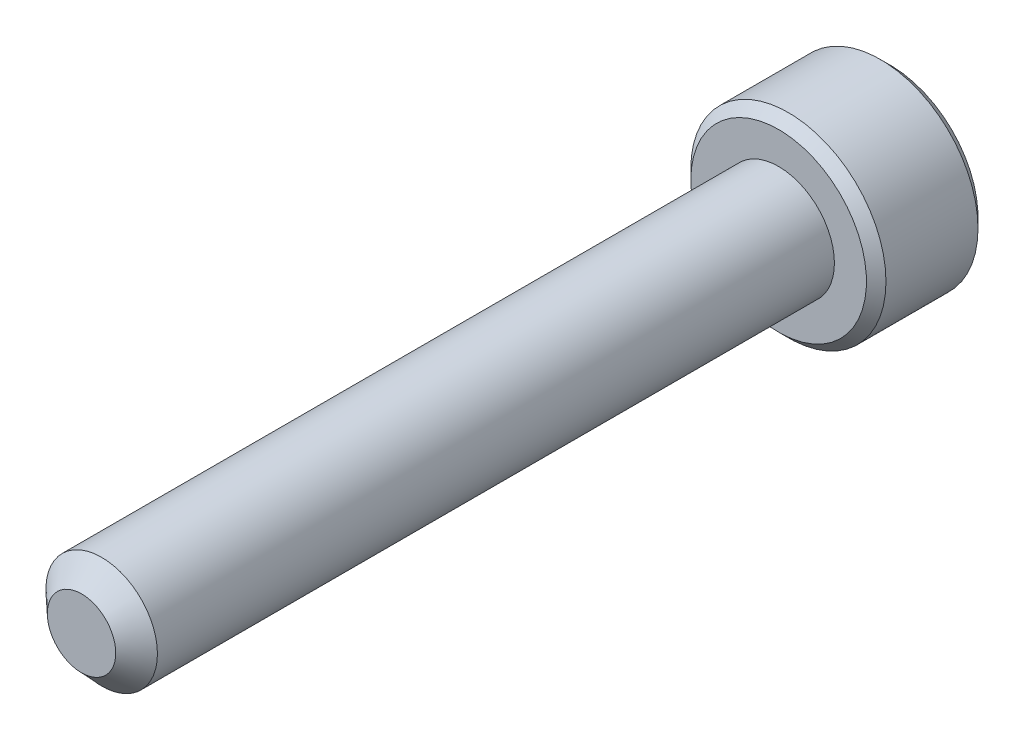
ISO-10303-21;
HEADER;
FILE_DESCRIPTION(('STEP AP214'),'2;1');
FILE_NAME('part.step','',(''),(''),'','','');
FILE_SCHEMA(('AUTOMOTIVE_DESIGN { 1 0 10303 214 1 1 1 1 }'));
ENDSEC;
DATA;
#1=APPLICATION_CONTEXT('core data for automotive mechanical design processes');
#2=APPLICATION_PROTOCOL_DEFINITION('international standard','automotive_design',2000,#1);
#3=PRODUCT_CONTEXT('',#1,'mechanical');
#4=PRODUCT('Part','Part','',(#3));
#5=PRODUCT_RELATED_PRODUCT_CATEGORY('part','',(#4));
#6=PRODUCT_DEFINITION_FORMATION('','',#4);
#7=PRODUCT_DEFINITION_CONTEXT('part definition',#1,'design');
#8=PRODUCT_DEFINITION('design','',#6,#7);
#9=PRODUCT_DEFINITION_SHAPE('','',#8);
#10=(LENGTH_UNIT() NAMED_UNIT(*) SI_UNIT(.MILLI.,.METRE.));
#11=(NAMED_UNIT(*) PLANE_ANGLE_UNIT() SI_UNIT($,.RADIAN.));
#12=(NAMED_UNIT(*) SI_UNIT($,.STERADIAN.) SOLID_ANGLE_UNIT());
#13=UNCERTAINTY_MEASURE_WITH_UNIT(LENGTH_MEASURE(1.E-05),#10,'distance_accuracy_value','');
#14=(GEOMETRIC_REPRESENTATION_CONTEXT(3) GLOBAL_UNCERTAINTY_ASSIGNED_CONTEXT((#13)) GLOBAL_UNIT_ASSIGNED_CONTEXT((#10,
#11,#12)) REPRESENTATION_CONTEXT('',''));
#15=CARTESIAN_POINT('',(0.,0.,0.));
#16=DIRECTION('',(0.,0.,1.));
#17=DIRECTION('',(1.,0.,0.));
#18=AXIS2_PLACEMENT_3D('',#15,#16,#17);
#19=CARTESIAN_POINT('',(0.,0.,-25.));
#20=DIRECTION('',(0.,0.,1.));
#21=DIRECTION('',(1.,0.,0.));
#22=AXIS2_PLACEMENT_3D('',#19,#20,#21);
#23=CYLINDRICAL_SURFACE('',#22,2.);
#24=CARTESIAN_POINT('',(0.,0.,-25.));
#25=DIRECTION('',(0.,0.,-1.));
#26=DIRECTION('',(-1.,0.,0.));
#27=AXIS2_PLACEMENT_3D('',#24,#25,#26);
#28=CIRCLE('',#27,2.);
#29=CARTESIAN_POINT('',(-2.,0.,-25.));
#30=VERTEX_POINT('',#29);
#31=EDGE_CURVE('E203',#30,#30,#28,.F.);
#32=ORIENTED_EDGE('',*,*,#31,.T.);
#33=EDGE_LOOP('',(#32));
#34=FACE_BOUND('',#33,.T.);
#35=CARTESIAN_POINT('',(0.,0.,-0.721407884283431));
#36=DIRECTION('',(0.,0.,1.));
#37=DIRECTION('',(1.,0.,0.));
#38=AXIS2_PLACEMENT_3D('',#35,#36,#37);
#39=CIRCLE('',#38,2.);
#40=CARTESIAN_POINT('',(2.,0.,-0.721407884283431));
#41=VERTEX_POINT('',#40);
#42=EDGE_CURVE('E107',#41,#41,#39,.T.);
#43=ORIENTED_EDGE('',*,*,#42,.F.);
#44=EDGE_LOOP('',(#43));
#45=FACE_BOUND('',#44,.T.);
#46=ADVANCED_FACE('F34',(#34,#45),#23,.T.);
#47=CARTESIAN_POINT('',(0.,0.,0.));
#48=DIRECTION('',(0.,0.,-1.));
#49=DIRECTION('',(-1.,0.,0.));
#50=AXIS2_PLACEMENT_3D('',#47,#48,#49);
#51=CONICAL_SURFACE('',#50,1.22638475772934,0.820304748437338);
#52=ORIENTED_EDGE('',*,*,#42,.T.);
#53=EDGE_LOOP('',(#52));
#54=FACE_BOUND('',#53,.T.);
#55=CARTESIAN_POINT('',(0.,0.,0.));
#56=DIRECTION('',(0.,0.,1.));
#57=DIRECTION('',(1.,0.,0.));
#58=AXIS2_PLACEMENT_3D('',#55,#56,#57);
#59=CIRCLE('',#58,1.22638475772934);
#60=CARTESIAN_POINT('',(1.22638475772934,0.,0.));
#61=VERTEX_POINT('',#60);
#62=EDGE_CURVE('E206',#61,#61,#59,.T.);
#63=ORIENTED_EDGE('',*,*,#62,.F.);
#64=EDGE_LOOP('',(#63));
#65=FACE_BOUND('',#64,.T.);
#66=ADVANCED_FACE('F193',(#54,#65),#51,.T.);
#67=CARTESIAN_POINT('',(0.,0.,0.));
#68=DIRECTION('',(0.,0.,1.));
#69=DIRECTION('',(1.,0.,0.));
#70=AXIS2_PLACEMENT_3D('',#67,#68,#69);
#71=PLANE('',#70);
#72=ORIENTED_EDGE('',*,*,#62,.T.);
#73=EDGE_LOOP('',(#72));
#74=FACE_BOUND('',#73,.T.);
#75=ADVANCED_FACE('F190',(#74),#71,.T.);
#76=CARTESIAN_POINT('',(0.,0.,-29.));
#77=DIRECTION('',(0.,0.,1.));
#78=DIRECTION('',(1.,0.,0.));
#79=AXIS2_PLACEMENT_3D('',#76,#77,#78);
#80=CYLINDRICAL_SURFACE('',#79,3.5);
#81=CARTESIAN_POINT('',(0.,0.,-28.65));
#82=DIRECTION('',(0.,0.,-1.));
#83=DIRECTION('',(-1.,0.,0.));
#84=AXIS2_PLACEMENT_3D('',#81,#82,#83);
#85=CIRCLE('',#84,3.5);
#86=CARTESIAN_POINT('',(-3.5,0.,-28.65));
#87=VERTEX_POINT('',#86);
#88=EDGE_CURVE('E41',#87,#87,#85,.F.);
#89=ORIENTED_EDGE('',*,*,#88,.T.);
#90=EDGE_LOOP('',(#89));
#91=FACE_BOUND('',#90,.T.);
#92=CARTESIAN_POINT('',(0.,0.,-25.35));
#93=DIRECTION('',(0.,0.,-1.));
#94=DIRECTION('',(-1.,0.,0.));
#95=AXIS2_PLACEMENT_3D('',#92,#93,#94);
#96=CIRCLE('',#95,3.5);
#97=CARTESIAN_POINT('',(-3.5,0.,-25.35));
#98=VERTEX_POINT('',#97);
#99=EDGE_CURVE('E168',#98,#98,#96,.T.);
#100=ORIENTED_EDGE('',*,*,#99,.T.);
#101=EDGE_LOOP('',(#100));
#102=FACE_BOUND('',#101,.T.);
#103=ADVANCED_FACE('F173',(#91,#102),#80,.T.);
#104=CARTESIAN_POINT('',(0.,0.,-29.));
#105=DIRECTION('',(0.,0.,-1.));
#106=DIRECTION('',(-1.,0.,0.));
#107=AXIS2_PLACEMENT_3D('',#104,#105,#106);
#108=PLANE('',#107);
#109=CARTESIAN_POINT('',(0.,0.,-29.));
#110=DIRECTION('',(0.,0.,-1.));
#111=DIRECTION('',(-1.,0.,0.));
#112=AXIS2_PLACEMENT_3D('',#109,#110,#111);
#113=CIRCLE('',#112,3.15);
#114=CARTESIAN_POINT('',(-3.15000000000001,0.,-29.));
#115=VERTEX_POINT('',#114);
#116=EDGE_CURVE('E106',#115,#115,#113,.T.);
#117=ORIENTED_EDGE('',*,*,#116,.T.);
#118=EDGE_LOOP('',(#117));
#119=FACE_BOUND('',#118,.T.);
#120=CARTESIAN_POINT('',(0.,0.,-29.));
#121=DIRECTION('',(0.,0.,-1.));
#122=DIRECTION('',(-1.,0.,0.));
#123=AXIS2_PLACEMENT_3D('',#120,#121,#122);
#124=CIRCLE('',#123,1.73205080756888);
#125=CARTESIAN_POINT('',(-1.5,0.866025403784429,-29.));
#126=VERTEX_POINT('',#125);
#127=CARTESIAN_POINT('',(0.,1.73205080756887,-29.));
#128=VERTEX_POINT('',#127);
#129=EDGE_CURVE('E87',#126,#128,#124,.T.);
#130=ORIENTED_EDGE('',*,*,#129,.F.);
#131=CARTESIAN_POINT('',(-1.49999999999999,-0.866025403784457,-29.));
#132=VERTEX_POINT('',#131);
#133=EDGE_CURVE('E47',#132,#126,#124,.T.);
#134=ORIENTED_EDGE('',*,*,#133,.F.);
#135=CARTESIAN_POINT('',(0.,-1.73205080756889,-29.));
#136=VERTEX_POINT('',#135);
#137=EDGE_CURVE('E264',#136,#132,#124,.T.);
#138=ORIENTED_EDGE('',*,*,#137,.F.);
#139=CARTESIAN_POINT('',(1.49999999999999,-0.866025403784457,-29.));
#140=VERTEX_POINT('',#139);
#141=EDGE_CURVE('E54',#140,#136,#124,.T.);
#142=ORIENTED_EDGE('',*,*,#141,.F.);
#143=CARTESIAN_POINT('',(1.5,0.866025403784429,-29.));
#144=VERTEX_POINT('',#143);
#145=EDGE_CURVE('E128',#144,#140,#124,.T.);
#146=ORIENTED_EDGE('',*,*,#145,.F.);
#147=EDGE_CURVE('E96',#128,#144,#124,.T.);
#148=ORIENTED_EDGE('',*,*,#147,.F.);
#149=EDGE_LOOP('',(#130,#134,#138,#142,#146,#148));
#150=FACE_BOUND('',#149,.T.);
#151=ADVANCED_FACE('F127',(#119,#150),#108,.T.);
#152=CARTESIAN_POINT('',(0.,0.,-25.));
#153=DIRECTION('',(0.,0.,-1.));
#154=DIRECTION('',(-1.,0.,0.));
#155=AXIS2_PLACEMENT_3D('',#152,#153,#154);
#156=PLANE('',#155);
#157=CARTESIAN_POINT('',(0.,0.,-25.));
#158=DIRECTION('',(0.,0.,-1.));
#159=DIRECTION('',(-1.,0.,0.));
#160=AXIS2_PLACEMENT_3D('',#157,#158,#159);
#161=CIRCLE('',#160,3.15);
#162=CARTESIAN_POINT('',(-3.15,0.,-25.));
#163=VERTEX_POINT('',#162);
#164=EDGE_CURVE('E11',#163,#163,#161,.F.);
#165=ORIENTED_EDGE('',*,*,#164,.T.);
#166=EDGE_LOOP('',(#165));
#167=FACE_BOUND('',#166,.T.);
#168=ORIENTED_EDGE('',*,*,#31,.F.);
#169=EDGE_LOOP('',(#168));
#170=FACE_BOUND('',#169,.T.);
#171=ADVANCED_FACE('F183',(#167,#170),#156,.F.);
#172=CARTESIAN_POINT('',(0.,0.,-29.));
#173=DIRECTION('',(0.,0.,-1.));
#174=DIRECTION('',(-1.,0.,0.));
#175=AXIS2_PLACEMENT_3D('',#172,#173,#174);
#176=CONICAL_SURFACE('',#175,1.73205080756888,0.78539816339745);
#177=ORIENTED_EDGE('',*,*,#147,.T.);
#178=CARTESIAN_POINT('',(-0.000200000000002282,1.73216627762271,-29.0001154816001));
#179=CARTESIAN_POINT('',(0.0513677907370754,1.70239359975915,-28.9703654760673));
#180=CARTESIAN_POINT('',(0.103797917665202,1.67212305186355,-28.9423624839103));
#181=CARTESIAN_POINT('',(0.2107090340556,1.61039789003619,-28.8910892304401));
#182=CARTESIAN_POINT('',(0.265200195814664,1.57893740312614,-28.8678475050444));
#183=CARTESIAN_POINT('',(0.375079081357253,1.51549879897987,-28.8280337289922));
#184=CARTESIAN_POINT('',(0.430438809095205,1.4835368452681,-28.8113615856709));
#185=CARTESIAN_POINT('',(0.542377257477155,1.41890915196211,-28.7856744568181));
#186=CARTESIAN_POINT('',(0.598952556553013,1.38624538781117,-28.7766402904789));
#187=CARTESIAN_POINT('',(0.696455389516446,1.32995210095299,-28.7684890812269));
#188=CARTESIAN_POINT('',(0.737256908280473,1.30639533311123,-28.7672822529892));
#189=CARTESIAN_POINT('',(0.818787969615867,1.25932335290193,-28.7693140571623));
#190=CARTESIAN_POINT('',(0.859517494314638,1.23580815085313,-28.7725536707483));
#191=CARTESIAN_POINT('',(0.940584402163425,1.18900414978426,-28.783291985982));
#192=CARTESIAN_POINT('',(0.980921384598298,1.16571558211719,-28.7907946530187));
#193=CARTESIAN_POINT('',(1.06091833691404,1.11952932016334,-28.8096516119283));
#194=CARTESIAN_POINT('',(1.10057800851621,1.09663179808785,-28.8210075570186));
#195=CARTESIAN_POINT('',(1.20216313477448,1.03798159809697,-28.8547216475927));
#196=CARTESIAN_POINT('',(1.26345855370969,1.00259267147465,-28.8796218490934));
#197=CARTESIAN_POINT('',(1.35358562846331,0.950557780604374,-28.9216566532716));
#198=CARTESIAN_POINT('',(1.38328513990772,0.933410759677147,-28.9364251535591));
#199=CARTESIAN_POINT('',(1.44213790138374,0.899432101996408,-28.9673105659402));
#200=CARTESIAN_POINT('',(1.47129140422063,0.882600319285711,-28.9834268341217));
#201=CARTESIAN_POINT('',(1.50019999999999,0.865909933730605,-29.0001154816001));
#202=B_SPLINE_CURVE_WITH_KNOTS('',3,(#178,#179,#180,#181,#182,#183,#184,#185,#186,#187,#188,
#189,#190,#191,#192,#193,#194,#195,#196,#197,#198,#199,#200,#201),.UNSPECIFIED.,.F.,.F.,(4,2,2,
2,2,2,2,2,2,2,2,4),(0.,0.19982914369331,0.400822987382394,0.598623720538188,0.795926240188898,
0.937113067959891,1.07833105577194,1.21968061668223,1.36109089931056,1.58570969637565,
1.69770705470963,1.80965120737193),.UNSPECIFIED.);
#203=EDGE_CURVE('E101',#128,#144,#202,.T.);
#204=ORIENTED_EDGE('',*,*,#203,.F.);
#205=EDGE_LOOP('',(#177,#204));
#206=FACE_BOUND('',#205,.T.);
#207=ADVANCED_FACE('F102',(#206),#176,.F.);
#208=ORIENTED_EDGE('',*,*,#145,.T.);
#209=CARTESIAN_POINT('',(1.49999999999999,-1.72720812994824,-29.5555785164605));
#210=CARTESIAN_POINT('',(1.5,-1.68515175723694,-29.5238299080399));
#211=CARTESIAN_POINT('',(1.5,-1.64286104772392,-29.4923925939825));
#212=CARTESIAN_POINT('',(1.5,-1.55771581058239,-29.430269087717));
#213=CARTESIAN_POINT('',(1.5,-1.51486114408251,-29.3995830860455));
#214=CARTESIAN_POINT('',(1.5,-1.38468134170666,-29.3084071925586));
#215=CARTESIAN_POINT('',(1.5,-1.29637976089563,-29.2492883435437));
#216=CARTESIAN_POINT('',(1.5,-1.11121478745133,-29.1332309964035));
#217=CARTESIAN_POINT('',(1.50000000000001,-1.01415038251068,-29.0766095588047));
#218=CARTESIAN_POINT('',(1.5,-0.81517340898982,-28.9730368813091));
#219=CARTESIAN_POINT('',(1.49999999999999,-0.713278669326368,-28.9260530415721));
#220=CARTESIAN_POINT('',(1.49999999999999,-0.560333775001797,-28.8685726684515));
#221=CARTESIAN_POINT('',(1.5,-0.511547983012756,-28.8520753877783));
#222=CARTESIAN_POINT('',(1.5,-0.412798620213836,-28.8229975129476));
#223=CARTESIAN_POINT('',(1.5,-0.362834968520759,-28.8104171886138));
#224=CARTESIAN_POINT('',(1.5,-0.262863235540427,-28.7900361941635));
#225=CARTESIAN_POINT('',(1.5,-0.212872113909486,-28.7821536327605));
#226=CARTESIAN_POINT('',(1.5,-0.112355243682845,-28.7713220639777));
#227=CARTESIAN_POINT('',(1.49999999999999,-0.0618295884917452,-28.7683722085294));
#228=CARTESIAN_POINT('',(1.49999999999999,0.0374291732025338,-28.7676248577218));
#229=CARTESIAN_POINT('',(1.5,0.0861609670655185,-28.7696447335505));
#230=CARTESIAN_POINT('',(1.5,0.183206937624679,-28.7783225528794));
#231=CARTESIAN_POINT('',(1.5,0.231521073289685,-28.7849809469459));
#232=CARTESIAN_POINT('',(1.5,0.328199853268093,-28.802685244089));
#233=CARTESIAN_POINT('',(1.5,0.376550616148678,-28.8138058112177));
#234=CARTESIAN_POINT('',(1.5,0.472195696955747,-28.8398434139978));
#235=CARTESIAN_POINT('',(1.5,0.519490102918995,-28.8547601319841));
#236=CARTESIAN_POINT('',(1.49999999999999,0.66839128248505,-28.9073352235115));
#237=CARTESIAN_POINT('',(1.5,0.767878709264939,-28.9509812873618));
#238=CARTESIAN_POINT('',(1.5,0.962179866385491,-29.0480229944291));
#239=CARTESIAN_POINT('',(1.5,1.05697519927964,-29.1014536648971));
#240=CARTESIAN_POINT('',(1.5,1.23814273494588,-29.2116858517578));
#241=CARTESIAN_POINT('',(1.5,1.32469942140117,-29.2681879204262));
#242=CARTESIAN_POINT('',(1.5,1.45222331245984,-29.3555343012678));
#243=CARTESIAN_POINT('',(1.5,1.49418091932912,-29.3849577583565));
#244=CARTESIAN_POINT('',(1.5,1.57752272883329,-29.4445828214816));
#245=CARTESIAN_POINT('',(1.5,1.61890708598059,-29.4747842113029));
#246=CARTESIAN_POINT('',(1.49999999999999,1.66005277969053,-29.5053081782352));
#247=B_SPLINE_CURVE_WITH_KNOTS('',3,(#209,#210,#211,#212,#213,#214,#215,#216,#217,#218,#219,
#220,#221,#222,#223,#224,#225,#226,#227,#228,#229,#230,#231,#232,#233,#234,#235,#236,#237,#238,
#239,#240,#241,#242,#243,#244,#245,#246),.UNSPECIFIED.,.F.,.F.,(4,2,2,2,2,2,2,2,2,2,2,2,2,2,2,2,
2,2,4),(0.,0.158079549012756,0.316198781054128,0.634850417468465,0.971690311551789,
1.30737131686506,1.46173961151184,1.61611853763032,1.76772101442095,1.91929742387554,
2.06538741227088,2.21149159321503,2.36014984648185,2.50879566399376,2.83376031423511,
3.15991186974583,3.46985601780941,3.62358896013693,3.77727962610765),.UNSPECIFIED.);
#248=EDGE_CURVE('E95',#144,#140,#247,.F.);
#249=ORIENTED_EDGE('',*,*,#248,.F.);
#250=EDGE_LOOP('',(#208,#249));
#251=FACE_BOUND('',#250,.T.);
#252=ADVANCED_FACE('F270',(#251),#176,.F.);
#253=ORIENTED_EDGE('',*,*,#141,.T.);
#254=CARTESIAN_POINT('',(1.5002,-0.865909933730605,-29.0001154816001));
#255=CARTESIAN_POINT('',(1.44863220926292,-0.895682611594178,-28.9703654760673));
#256=CARTESIAN_POINT('',(1.3962020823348,-0.925953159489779,-28.9423624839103));
#257=CARTESIAN_POINT('',(1.2892909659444,-0.98767832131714,-28.8910892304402));
#258=CARTESIAN_POINT('',(1.23479980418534,-1.01913880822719,-28.8678475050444));
#259=CARTESIAN_POINT('',(1.12492091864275,-1.08257741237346,-28.8280337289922));
#260=CARTESIAN_POINT('',(1.0695611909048,-1.11453936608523,-28.8113615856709));
#261=CARTESIAN_POINT('',(0.957622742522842,-1.17916705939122,-28.7856744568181));
#262=CARTESIAN_POINT('',(0.90104744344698,-1.21183082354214,-28.7766402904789));
#263=CARTESIAN_POINT('',(0.80354461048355,-1.26812411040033,-28.7684890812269));
#264=CARTESIAN_POINT('',(0.762743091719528,-1.29168087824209,-28.7672822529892));
#265=CARTESIAN_POINT('',(0.681212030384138,-1.3387528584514,-28.7693140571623));
#266=CARTESIAN_POINT('',(0.640482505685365,-1.3622680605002,-28.7725536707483));
#267=CARTESIAN_POINT('',(0.559415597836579,-1.40907206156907,-28.783291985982));
#268=CARTESIAN_POINT('',(0.519078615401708,-1.43236062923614,-28.7907946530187));
#269=CARTESIAN_POINT('',(0.439081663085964,-1.47854689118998,-28.8096516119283));
#270=CARTESIAN_POINT('',(0.399421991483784,-1.50144441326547,-28.8210075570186));
#271=CARTESIAN_POINT('',(0.297836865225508,-1.56009461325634,-28.8547216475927));
#272=CARTESIAN_POINT('',(0.236541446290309,-1.59548353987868,-28.8796218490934));
#273=CARTESIAN_POINT('',(0.14641437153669,-1.64751843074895,-28.9216566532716));
#274=CARTESIAN_POINT('',(0.116714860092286,-1.66466545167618,-28.9364251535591));
#275=CARTESIAN_POINT('',(0.0578620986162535,-1.69864410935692,-28.9673105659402));
#276=CARTESIAN_POINT('',(0.0287085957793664,-1.71547589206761,-28.9834268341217));
#277=CARTESIAN_POINT('',(-0.000199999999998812,-1.73216627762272,-29.0001154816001));
#278=B_SPLINE_CURVE_WITH_KNOTS('',3,(#254,#255,#256,#257,#258,#259,#260,#261,#262,#263,#264,
#265,#266,#267,#268,#269,#270,#271,#272,#273,#274,#275,#276,#277),.UNSPECIFIED.,.F.,.F.,(4,2,2,
2,2,2,2,2,2,2,2,4),(0.,0.199829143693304,0.400822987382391,0.598623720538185,0.795926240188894,
0.937113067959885,1.07833105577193,1.21968061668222,1.36109089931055,1.58570969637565,
1.69770705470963,1.80965120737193),.UNSPECIFIED.);
#279=EDGE_CURVE('E137',#140,#136,#278,.T.);
#280=ORIENTED_EDGE('',*,*,#279,.F.);
#281=EDGE_LOOP('',(#253,#280));
#282=FACE_BOUND('',#281,.T.);
#283=ADVANCED_FACE('F267',(#282),#176,.F.);
#284=ORIENTED_EDGE('',*,*,#137,.T.);
#285=CARTESIAN_POINT('',(0.000199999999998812,-1.73216627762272,-29.0001154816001));
#286=CARTESIAN_POINT('',(-0.0513677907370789,-1.70239359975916,-28.9703654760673));
#287=CARTESIAN_POINT('',(-0.103797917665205,-1.67212305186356,-28.9423624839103));
#288=CARTESIAN_POINT('',(-0.210709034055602,-1.6103978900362,-28.8910892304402));
#289=CARTESIAN_POINT('',(-0.265200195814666,-1.57893740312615,-28.8678475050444));
#290=CARTESIAN_POINT('',(-0.375079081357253,-1.51549879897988,-28.8280337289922));
#291=CARTESIAN_POINT('',(-0.430438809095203,-1.48353684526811,-28.8113615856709));
#292=CARTESIAN_POINT('',(-0.542377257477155,-1.41890915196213,-28.7856744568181));
#293=CARTESIAN_POINT('',(-0.598952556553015,-1.3862453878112,-28.7766402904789));
#294=CARTESIAN_POINT('',(-0.696455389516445,-1.32995210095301,-28.7684890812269));
#295=CARTESIAN_POINT('',(-0.737256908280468,-1.30639533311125,-28.7672822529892));
#296=CARTESIAN_POINT('',(-0.818787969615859,-1.25932335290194,-28.7693140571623));
#297=CARTESIAN_POINT('',(-0.859517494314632,-1.23580815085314,-28.7725536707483));
#298=CARTESIAN_POINT('',(-0.940584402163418,-1.18900414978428,-28.783291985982));
#299=CARTESIAN_POINT('',(-0.98092138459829,-1.16571558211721,-28.7907946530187));
#300=CARTESIAN_POINT('',(-1.06091833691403,-1.11952932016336,-28.8096516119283));
#301=CARTESIAN_POINT('',(-1.10057800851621,-1.09663179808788,-28.8210075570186));
#302=CARTESIAN_POINT('',(-1.20216313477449,-1.037981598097,-28.8547216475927));
#303=CARTESIAN_POINT('',(-1.26345855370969,-1.00259267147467,-28.8796218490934));
#304=CARTESIAN_POINT('',(-1.35358562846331,-0.950557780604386,-28.9216566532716));
#305=CARTESIAN_POINT('',(-1.38328513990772,-0.933410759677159,-28.9364251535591));
#306=CARTESIAN_POINT('',(-1.44213790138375,-0.89943210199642,-28.9673105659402));
#307=CARTESIAN_POINT('',(-1.47129140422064,-0.882600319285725,-28.9834268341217));
#308=CARTESIAN_POINT('',(-1.5002,-0.865909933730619,-29.0001154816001));
#309=B_SPLINE_CURVE_WITH_KNOTS('',3,(#285,#286,#287,#288,#289,#290,#291,#292,#293,#294,#295,
#296,#297,#298,#299,#300,#301,#302,#303,#304,#305,#306,#307,#308),.UNSPECIFIED.,.F.,.F.,(4,2,2,
2,2,2,2,2,2,2,2,4),(0.,0.199829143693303,0.400822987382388,0.598623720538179,0.795926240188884,
0.937113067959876,1.07833105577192,1.21968061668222,1.36109089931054,1.58570969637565,
1.69770705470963,1.80965120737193),.UNSPECIFIED.);
#310=EDGE_CURVE('E242',#136,#132,#309,.T.);
#311=ORIENTED_EDGE('',*,*,#310,.F.);
#312=EDGE_LOOP('',(#284,#311));
#313=FACE_BOUND('',#312,.T.);
#314=ADVANCED_FACE('F266',(#313),#176,.F.);
#315=ORIENTED_EDGE('',*,*,#133,.T.);
#316=CARTESIAN_POINT('',(-1.50000000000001,-1.72720812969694,-29.5555785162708));
#317=CARTESIAN_POINT('',(-1.5,-1.68515175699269,-29.5238299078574));
#318=CARTESIAN_POINT('',(-1.5,-1.64286104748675,-29.4923925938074));
#319=CARTESIAN_POINT('',(-1.49999999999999,-1.55771581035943,-29.4302690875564));
#320=CARTESIAN_POINT('',(-1.49999999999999,-1.51486114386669,-29.3995830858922));
#321=CARTESIAN_POINT('',(-1.5,-1.38468134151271,-29.3084071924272));
#322=CARTESIAN_POINT('',(-1.5,-1.29637976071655,-29.2492883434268));
#323=CARTESIAN_POINT('',(-1.49999999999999,-1.11121478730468,-29.1332309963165));
#324=CARTESIAN_POINT('',(-1.49999999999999,-1.01415038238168,-29.076609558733));
#325=CARTESIAN_POINT('',(-1.5,-0.81517340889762,-28.9730368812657));
#326=CARTESIAN_POINT('',(-1.50000000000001,-0.713278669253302,-28.9260530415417));
#327=CARTESIAN_POINT('',(-1.5,-0.56033377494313,-28.8685726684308));
#328=CARTESIAN_POINT('',(-1.5,-0.511547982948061,-28.8520753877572));
#329=CARTESIAN_POINT('',(-1.49999999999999,-0.412798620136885,-28.822997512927));
#330=CARTESIAN_POINT('',(-1.49999999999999,-0.362834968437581,-28.810417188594));
#331=CARTESIAN_POINT('',(-1.49999999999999,-0.262863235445,-28.7900361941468));
#332=CARTESIAN_POINT('',(-1.49999999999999,-0.21287211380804,-28.782153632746));
#333=CARTESIAN_POINT('',(-1.5,-0.112355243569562,-28.771322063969));
#334=CARTESIAN_POINT('',(-1.5,-0.0618295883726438,-28.7683722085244));
#335=CARTESIAN_POINT('',(-1.5,0.0374291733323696,-28.7676248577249));
#336=CARTESIAN_POINT('',(-1.5,0.0861609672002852,-28.7696447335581));
#337=CARTESIAN_POINT('',(-1.49999999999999,0.183206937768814,-28.7783225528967));
#338=CARTESIAN_POINT('',(-1.49999999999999,0.231521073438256,-28.7849809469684));
#339=CARTESIAN_POINT('',(-1.49999999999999,0.328199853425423,-28.8026852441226));
#340=CARTESIAN_POINT('',(-1.49999999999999,0.376550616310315,-28.813805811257));
#341=CARTESIAN_POINT('',(-1.5,0.472195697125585,-28.8398434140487));
#342=CARTESIAN_POINT('',(-1.5,0.519490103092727,-28.8547601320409));
#343=CARTESIAN_POINT('',(-1.5,0.668391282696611,-28.9073352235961));
#344=CARTESIAN_POINT('',(-1.5,0.767878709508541,-28.950981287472));
#345=CARTESIAN_POINT('',(-1.49999999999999,0.962179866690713,-29.0480229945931));
#346=CARTESIAN_POINT('',(-1.49999999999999,1.05697519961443,-29.1014536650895));
#347=CARTESIAN_POINT('',(-1.5,1.23814273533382,-29.2116858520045));
#348=CARTESIAN_POINT('',(-1.5,1.32469942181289,-29.2681879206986));
#349=CARTESIAN_POINT('',(-1.5,1.45222331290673,-29.3555343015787));
#350=CARTESIAN_POINT('',(-1.49999999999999,1.49418091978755,-29.38495775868));
#351=CARTESIAN_POINT('',(-1.5,1.57752272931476,-29.4445828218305));
#352=CARTESIAN_POINT('',(-1.5,1.61890708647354,-29.4747842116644));
#353=CARTESIAN_POINT('',(-1.5,1.66005278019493,-29.5053081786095));
#354=B_SPLINE_CURVE_WITH_KNOTS('',3,(#316,#317,#318,#319,#320,#321,#322,#323,#324,#325,#326,
#327,#328,#329,#330,#331,#332,#333,#334,#335,#336,#337,#338,#339,#340,#341,#342,#343,#344,#345,
#346,#347,#348,#349,#350,#351,#352,#353),.UNSPECIFIED.,.F.,.F.,(4,2,2,2,2,2,2,2,2,2,2,2,2,2,2,2,
2,2,4),(0.,0.158079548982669,0.316198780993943,0.634850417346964,0.971690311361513,
1.30737131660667,1.46173961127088,1.61611853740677,1.7677210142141,1.91929742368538,
2.06538741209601,2.21149159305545,2.36014984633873,2.5087956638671,2.83376031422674,
3.15991186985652,3.46985601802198,3.62358896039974,3.77727962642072),.UNSPECIFIED.);
#355=EDGE_CURVE('E117',#132,#126,#354,.T.);
#356=ORIENTED_EDGE('',*,*,#355,.F.);
#357=EDGE_LOOP('',(#315,#356));
#358=FACE_BOUND('',#357,.T.);
#359=ADVANCED_FACE('F279',(#358),#176,.F.);
#360=ORIENTED_EDGE('',*,*,#129,.T.);
#361=CARTESIAN_POINT('',(-1.50020000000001,0.865909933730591,-29.0001154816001));
#362=CARTESIAN_POINT('',(-1.44863220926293,0.895682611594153,-28.9703654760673));
#363=CARTESIAN_POINT('',(-1.39620208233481,0.925953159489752,-28.9423624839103));
#364=CARTESIAN_POINT('',(-1.28929096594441,0.987678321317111,-28.8910892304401));
#365=CARTESIAN_POINT('',(-1.23479980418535,1.01913880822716,-28.8678475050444));
#366=CARTESIAN_POINT('',(-1.12492091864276,1.08257741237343,-28.8280337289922));
#367=CARTESIAN_POINT('',(-1.06956119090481,1.1145393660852,-28.8113615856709));
#368=CARTESIAN_POINT('',(-0.957622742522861,1.17916705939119,-28.7856744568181));
#369=CARTESIAN_POINT('',(-0.901047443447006,1.21183082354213,-28.7766402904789));
#370=CARTESIAN_POINT('',(-0.803544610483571,1.26812411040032,-28.7684890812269));
#371=CARTESIAN_POINT('',(-0.762743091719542,1.29168087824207,-28.7672822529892));
#372=CARTESIAN_POINT('',(-0.681212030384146,1.33875285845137,-28.7693140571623));
#373=CARTESIAN_POINT('',(-0.640482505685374,1.36226806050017,-28.7725536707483));
#374=CARTESIAN_POINT('',(-0.559415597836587,1.40907206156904,-28.7832919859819));
#375=CARTESIAN_POINT('',(-0.519078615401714,1.43236062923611,-28.7907946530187));
#376=CARTESIAN_POINT('',(-0.43908166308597,1.47854689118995,-28.8096516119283));
#377=CARTESIAN_POINT('',(-0.399421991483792,1.50144441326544,-28.8210075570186));
#378=CARTESIAN_POINT('',(-0.297836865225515,1.56009461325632,-28.8547216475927));
#379=CARTESIAN_POINT('',(-0.236541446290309,1.59548353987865,-28.8796218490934));
#380=CARTESIAN_POINT('',(-0.146414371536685,1.64751843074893,-28.9216566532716));
#381=CARTESIAN_POINT('',(-0.116714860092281,1.66466545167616,-28.9364251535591));
#382=CARTESIAN_POINT('',(-0.0578620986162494,1.6986441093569,-28.9673105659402));
#383=CARTESIAN_POINT('',(-0.0287085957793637,1.71547589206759,-28.9834268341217));
#384=CARTESIAN_POINT('',(0.000199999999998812,1.7321662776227,-29.0001154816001));
#385=B_SPLINE_CURVE_WITH_KNOTS('',3,(#361,#362,#363,#364,#365,#366,#367,#368,#369,#370,#371,
#372,#373,#374,#375,#376,#377,#378,#379,#380,#381,#382,#383,#384),.UNSPECIFIED.,.F.,.F.,(4,2,2,
2,2,2,2,2,2,2,2,4),(0.,0.199829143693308,0.40082298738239,0.59862372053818,0.795926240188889,
0.937113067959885,1.07833105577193,1.21968061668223,1.36109089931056,1.58570969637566,
1.69770705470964,1.80965120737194),.UNSPECIFIED.);
#386=EDGE_CURVE('E91',#126,#128,#385,.T.);
#387=ORIENTED_EDGE('',*,*,#386,.F.);
#388=EDGE_LOOP('',(#360,#387));
#389=FACE_BOUND('',#388,.T.);
#390=ADVANCED_FACE('F89',(#389),#176,.F.);
#391=CARTESIAN_POINT('',(0.,1.73205080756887,-26.75));
#392=DIRECTION('',(0.,0.,-1.));
#393=DIRECTION('',(-1.,0.,0.));
#394=AXIS2_PLACEMENT_3D('',#391,#392,#393);
#395=PLANE('',#394);
#396=DIRECTION('',(0.86602540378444,0.500000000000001,0.));
#397=VECTOR('',#396,1.);
#398=CARTESIAN_POINT('',(-1.5,0.866025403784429,-26.75));
#399=LINE('',#398,#397);
#400=CARTESIAN_POINT('',(-1.5,0.866025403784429,-26.75));
#401=VERTEX_POINT('',#400);
#402=CARTESIAN_POINT('',(0.,1.73205080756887,-26.75));
#403=VERTEX_POINT('',#402);
#404=EDGE_CURVE('E116',#401,#403,#399,.T.);
#405=ORIENTED_EDGE('',*,*,#404,.T.);
#406=DIRECTION('',(0.866025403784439,-0.500000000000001,0.));
#407=VECTOR('',#406,1.);
#408=CARTESIAN_POINT('',(0.,1.73205080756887,-26.75));
#409=LINE('',#408,#407);
#410=CARTESIAN_POINT('',(1.5,0.866025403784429,-26.75));
#411=VERTEX_POINT('',#410);
#412=EDGE_CURVE('E121',#403,#411,#409,.T.);
#413=ORIENTED_EDGE('',*,*,#412,.T.);
#414=DIRECTION('',(0.,-1.,0.));
#415=VECTOR('',#414,1.);
#416=CARTESIAN_POINT('',(1.5,0.866025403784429,-26.75));
#417=LINE('',#416,#415);
#418=CARTESIAN_POINT('',(1.49999999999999,-0.866025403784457,-26.75));
#419=VERTEX_POINT('',#418);
#420=EDGE_CURVE('E230',#411,#419,#417,.T.);
#421=ORIENTED_EDGE('',*,*,#420,.T.);
#422=DIRECTION('',(-0.86602540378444,-0.500000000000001,0.));
#423=VECTOR('',#422,1.);
#424=CARTESIAN_POINT('',(1.49999999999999,-0.866025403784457,-26.75));
#425=LINE('',#424,#423);
#426=CARTESIAN_POINT('',(0.,-1.73205080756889,-26.75));
#427=VERTEX_POINT('',#426);
#428=EDGE_CURVE('E227',#419,#427,#425,.T.);
#429=ORIENTED_EDGE('',*,*,#428,.T.);
#430=DIRECTION('',(-0.866025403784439,0.5,0.));
#431=VECTOR('',#430,1.);
#432=CARTESIAN_POINT('',(0.,-1.73205080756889,-26.75));
#433=LINE('',#432,#431);
#434=CARTESIAN_POINT('',(-1.49999999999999,-0.866025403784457,-26.75));
#435=VERTEX_POINT('',#434);
#436=EDGE_CURVE('E224',#427,#435,#433,.T.);
#437=ORIENTED_EDGE('',*,*,#436,.T.);
#438=DIRECTION('',(0.,1.,0.));
#439=VECTOR('',#438,1.);
#440=CARTESIAN_POINT('',(-1.49999999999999,-0.866025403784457,-26.75));
#441=LINE('',#440,#439);
#442=EDGE_CURVE('E124',#435,#401,#441,.T.);
#443=ORIENTED_EDGE('',*,*,#442,.T.);
#444=EDGE_LOOP('',(#405,#413,#421,#429,#437,#443));
#445=FACE_BOUND('',#444,.T.);
#446=ADVANCED_FACE('F157',(#445),#395,.T.);
#447=CARTESIAN_POINT('',(0.,1.73205080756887,-26.75));
#448=DIRECTION('',(0.500000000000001,0.866025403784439,0.));
#449=DIRECTION('',(-0.866025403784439,0.500000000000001,0.));
#450=AXIS2_PLACEMENT_3D('',#447,#448,#449);
#451=PLANE('',#450);
#452=DIRECTION('',(0.,0.,-1.));
#453=VECTOR('',#452,1.);
#454=CARTESIAN_POINT('',(0.,1.73205080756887,-26.75));
#455=LINE('',#454,#453);
#456=EDGE_CURVE('E113',#403,#128,#455,.T.);
#457=ORIENTED_EDGE('',*,*,#456,.T.);
#458=ORIENTED_EDGE('',*,*,#203,.T.);
#459=DIRECTION('',(0.,0.,-1.));
#460=VECTOR('',#459,1.);
#461=CARTESIAN_POINT('',(1.5,0.866025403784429,-26.75));
#462=LINE('',#461,#460);
#463=EDGE_CURVE('E123',#411,#144,#462,.T.);
#464=ORIENTED_EDGE('',*,*,#463,.F.);
#465=ORIENTED_EDGE('',*,*,#412,.F.);
#466=EDGE_LOOP('',(#457,#458,#464,#465));
#467=FACE_BOUND('',#466,.T.);
#468=ADVANCED_FACE('F119',(#467),#451,.F.);
#469=CARTESIAN_POINT('',(1.5,0.866025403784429,-26.75));
#470=DIRECTION('',(1.,0.,0.));
#471=DIRECTION('',(0.,1.,0.));
#472=AXIS2_PLACEMENT_3D('',#469,#470,#471);
#473=PLANE('',#472);
#474=ORIENTED_EDGE('',*,*,#463,.T.);
#475=ORIENTED_EDGE('',*,*,#248,.T.);
#476=DIRECTION('',(0.,0.,-1.));
#477=VECTOR('',#476,1.);
#478=CARTESIAN_POINT('',(1.49999999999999,-0.866025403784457,-26.75));
#479=LINE('',#478,#477);
#480=EDGE_CURVE('E213',#419,#140,#479,.T.);
#481=ORIENTED_EDGE('',*,*,#480,.F.);
#482=ORIENTED_EDGE('',*,*,#420,.F.);
#483=EDGE_LOOP('',(#474,#475,#481,#482));
#484=FACE_BOUND('',#483,.T.);
#485=ADVANCED_FACE('F146',(#484),#473,.F.);
#486=CARTESIAN_POINT('',(1.49999999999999,-0.866025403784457,-26.75));
#487=DIRECTION('',(0.5,-0.86602540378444,0.));
#488=DIRECTION('',(0.86602540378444,0.500000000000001,0.));
#489=AXIS2_PLACEMENT_3D('',#486,#487,#488);
#490=PLANE('',#489);
#491=ORIENTED_EDGE('',*,*,#480,.T.);
#492=ORIENTED_EDGE('',*,*,#279,.T.);
#493=DIRECTION('',(0.,0.,-1.));
#494=VECTOR('',#493,1.);
#495=CARTESIAN_POINT('',(0.,-1.73205080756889,-26.75));
#496=LINE('',#495,#494);
#497=EDGE_CURVE('E216',#427,#136,#496,.T.);
#498=ORIENTED_EDGE('',*,*,#497,.F.);
#499=ORIENTED_EDGE('',*,*,#428,.F.);
#500=EDGE_LOOP('',(#491,#492,#498,#499));
#501=FACE_BOUND('',#500,.T.);
#502=ADVANCED_FACE('F150',(#501),#490,.F.);
#503=CARTESIAN_POINT('',(0.,-1.73205080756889,-26.75));
#504=DIRECTION('',(-0.500000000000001,-0.86602540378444,0.));
#505=DIRECTION('',(0.866025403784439,-0.5,0.));
#506=AXIS2_PLACEMENT_3D('',#503,#504,#505);
#507=PLANE('',#506);
#508=ORIENTED_EDGE('',*,*,#497,.T.);
#509=ORIENTED_EDGE('',*,*,#310,.T.);
#510=DIRECTION('',(0.,0.,-1.));
#511=VECTOR('',#510,1.);
#512=CARTESIAN_POINT('',(-1.49999999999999,-0.866025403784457,-26.75));
#513=LINE('',#512,#511);
#514=EDGE_CURVE('E219',#435,#132,#513,.T.);
#515=ORIENTED_EDGE('',*,*,#514,.F.);
#516=ORIENTED_EDGE('',*,*,#436,.F.);
#517=EDGE_LOOP('',(#508,#509,#515,#516));
#518=FACE_BOUND('',#517,.T.);
#519=ADVANCED_FACE('F249',(#518),#507,.F.);
#520=CARTESIAN_POINT('',(-1.49999999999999,-0.866025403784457,-26.75));
#521=DIRECTION('',(-1.,0.,0.));
#522=DIRECTION('',(0.,0.,1.));
#523=AXIS2_PLACEMENT_3D('',#520,#521,#522);
#524=PLANE('',#523);
#525=ORIENTED_EDGE('',*,*,#514,.T.);
#526=ORIENTED_EDGE('',*,*,#355,.T.);
#527=DIRECTION('',(0.,0.,-1.));
#528=VECTOR('',#527,1.);
#529=CARTESIAN_POINT('',(-1.5,0.866025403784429,-26.75));
#530=LINE('',#529,#528);
#531=EDGE_CURVE('E115',#401,#126,#530,.T.);
#532=ORIENTED_EDGE('',*,*,#531,.F.);
#533=ORIENTED_EDGE('',*,*,#442,.F.);
#534=EDGE_LOOP('',(#525,#526,#532,#533));
#535=FACE_BOUND('',#534,.T.);
#536=ADVANCED_FACE('F246',(#535),#524,.F.);
#537=CARTESIAN_POINT('',(-1.5,0.866025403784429,-26.75));
#538=DIRECTION('',(-0.5,0.866025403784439,0.));
#539=DIRECTION('',(-0.86602540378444,-0.500000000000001,0.));
#540=AXIS2_PLACEMENT_3D('',#537,#538,#539);
#541=PLANE('',#540);
#542=ORIENTED_EDGE('',*,*,#531,.T.);
#543=ORIENTED_EDGE('',*,*,#386,.T.);
#544=ORIENTED_EDGE('',*,*,#456,.F.);
#545=ORIENTED_EDGE('',*,*,#404,.F.);
#546=EDGE_LOOP('',(#542,#543,#544,#545));
#547=FACE_BOUND('',#546,.T.);
#548=ADVANCED_FACE('F111',(#547),#541,.F.);
#549=CARTESIAN_POINT('',(0.,0.,-29.));
#550=DIRECTION('',(0.,0.,1.));
#551=DIRECTION('',(1.,0.,0.));
#552=AXIS2_PLACEMENT_3D('',#549,#550,#551);
#553=CONICAL_SURFACE('',#552,3.15,0.785398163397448);
#554=ORIENTED_EDGE('',*,*,#88,.F.);
#555=EDGE_LOOP('',(#554));
#556=FACE_BOUND('',#555,.T.);
#557=ORIENTED_EDGE('',*,*,#116,.F.);
#558=EDGE_LOOP('',(#557));
#559=FACE_BOUND('',#558,.T.);
#560=ADVANCED_FACE('F176',(#556,#559),#553,.T.);
#561=CARTESIAN_POINT('',(0.,0.,-25.35));
#562=DIRECTION('',(0.,0.,-1.));
#563=DIRECTION('',(-1.,0.,0.));
#564=AXIS2_PLACEMENT_3D('',#561,#562,#563);
#565=CONICAL_SURFACE('',#564,3.5,0.785398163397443);
#566=ORIENTED_EDGE('',*,*,#164,.F.);
#567=EDGE_LOOP('',(#566));
#568=FACE_BOUND('',#567,.T.);
#569=ORIENTED_EDGE('',*,*,#99,.F.);
#570=EDGE_LOOP('',(#569));
#571=FACE_BOUND('',#570,.T.);
#572=ADVANCED_FACE('F179',(#568,#571),#565,.T.);
#573=CLOSED_SHELL('',(#46,#66,#75,#103,#151,#171,#207,#252,#283,#314,#359,#390,#446,#468,#485,
#502,#519,#536,#548,#560,#572));
#574=MANIFOLD_SOLID_BREP('B2',#573);
#575=ADVANCED_BREP_SHAPE_REPRESENTATION('',(#18,#574),#14);
#576=SHAPE_DEFINITION_REPRESENTATION(#9,#575);
ENDSEC;
END-ISO-10303-21;
